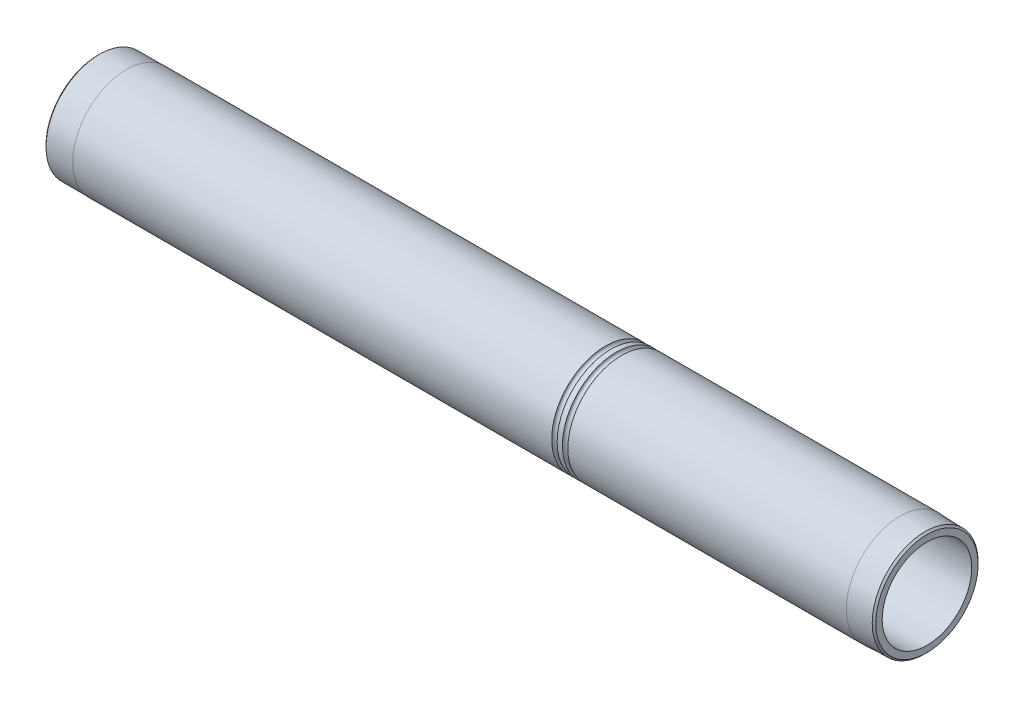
ISO-10303-21;
HEADER;
FILE_DESCRIPTION(('STEP AP214'),'2;1');
FILE_NAME('part.step','',(''),(''),'','','');
FILE_SCHEMA(('AUTOMOTIVE_DESIGN { 1 0 10303 214 1 1 1 1 }'));
ENDSEC;
DATA;
#1=APPLICATION_CONTEXT('core data for automotive mechanical design processes');
#2=APPLICATION_PROTOCOL_DEFINITION('international standard','automotive_design',2000,#1);
#3=PRODUCT_CONTEXT('',#1,'mechanical');
#4=PRODUCT('Part','Part','',(#3));
#5=PRODUCT_RELATED_PRODUCT_CATEGORY('part','',(#4));
#6=PRODUCT_DEFINITION_FORMATION('','',#4);
#7=PRODUCT_DEFINITION_CONTEXT('part definition',#1,'design');
#8=PRODUCT_DEFINITION('design','',#6,#7);
#9=PRODUCT_DEFINITION_SHAPE('','',#8);
#10=(LENGTH_UNIT() NAMED_UNIT(*) SI_UNIT(.MILLI.,.METRE.));
#11=(NAMED_UNIT(*) PLANE_ANGLE_UNIT() SI_UNIT($,.RADIAN.));
#12=(NAMED_UNIT(*) SI_UNIT($,.STERADIAN.) SOLID_ANGLE_UNIT());
#13=UNCERTAINTY_MEASURE_WITH_UNIT(LENGTH_MEASURE(1.E-05),#10,'distance_accuracy_value','');
#14=(GEOMETRIC_REPRESENTATION_CONTEXT(3) GLOBAL_UNCERTAINTY_ASSIGNED_CONTEXT((#13)) GLOBAL_UNIT_ASSIGNED_CONTEXT((#10,
#11,#12)) REPRESENTATION_CONTEXT('',''));
#15=CARTESIAN_POINT('',(0.,0.,0.));
#16=DIRECTION('',(0.,0.,1.));
#17=DIRECTION('',(1.,0.,0.));
#18=AXIS2_PLACEMENT_3D('',#15,#16,#17);
#19=CARTESIAN_POINT('',(0.,0.,0.));
#20=DIRECTION('',(-1.,0.,0.));
#21=DIRECTION('',(0.,0.,1.));
#22=AXIS2_PLACEMENT_3D('',#19,#20,#21);
#23=CYLINDRICAL_SURFACE('',#22,25.);
#24=CARTESIAN_POINT('',(165.,0.,0.));
#25=DIRECTION('',(-1.,0.,0.));
#26=DIRECTION('',(0.,0.,1.));
#27=AXIS2_PLACEMENT_3D('',#24,#25,#26);
#28=CIRCLE('',#27,25.);
#29=CARTESIAN_POINT('',(165.,0.,25.));
#30=VERTEX_POINT('',#29);
#31=EDGE_CURVE('E69',#30,#30,#28,.F.);
#32=ORIENTED_EDGE('',*,*,#31,.F.);
#33=EDGE_LOOP('',(#32));
#34=FACE_BOUND('',#33,.T.);
#35=CARTESIAN_POINT('',(211.8,0.,0.));
#36=DIRECTION('',(1.,0.,0.));
#37=DIRECTION('',(0.,0.,-1.));
#38=AXIS2_PLACEMENT_3D('',#35,#36,#37);
#39=CIRCLE('',#38,25.);
#40=CARTESIAN_POINT('',(211.8,0.,-25.));
#41=VERTEX_POINT('',#40);
#42=EDGE_CURVE('E40',#41,#41,#39,.F.);
#43=ORIENTED_EDGE('',*,*,#42,.F.);
#44=EDGE_LOOP('',(#43));
#45=FACE_BOUND('',#44,.T.);
#46=ADVANCED_FACE('F36',(#34,#45),#23,.F.);
#47=CARTESIAN_POINT('',(628.,0.,0.));
#48=DIRECTION('',(-1.,0.,0.));
#49=DIRECTION('',(0.,0.,1.));
#50=AXIS2_PLACEMENT_3D('',#47,#48,#49);
#51=CIRCLE('',#50,25.);
#52=CARTESIAN_POINT('',(628.,0.,25.));
#53=VERTEX_POINT('',#52);
#54=EDGE_CURVE('E49',#53,#53,#51,.T.);
#55=ORIENTED_EDGE('',*,*,#54,.F.);
#56=EDGE_LOOP('',(#55));
#57=FACE_BOUND('',#56,.T.);
#58=CARTESIAN_POINT('',(215.,0.,0.));
#59=DIRECTION('',(-1.,0.,0.));
#60=DIRECTION('',(0.,0.,1.));
#61=AXIS2_PLACEMENT_3D('',#58,#59,#60);
#62=CIRCLE('',#61,25.);
#63=CARTESIAN_POINT('',(215.,0.,25.));
#64=VERTEX_POINT('',#63);
#65=EDGE_CURVE('E76',#64,#64,#62,.F.);
#66=ORIENTED_EDGE('',*,*,#65,.F.);
#67=EDGE_LOOP('',(#66));
#68=FACE_BOUND('',#67,.T.);
#69=ADVANCED_FACE('F112',(#57,#68),#23,.F.);
#70=CARTESIAN_POINT('',(0.,0.,0.));
#71=DIRECTION('',(-1.,0.,0.));
#72=DIRECTION('',(0.,0.,1.));
#73=AXIS2_PLACEMENT_3D('',#70,#71,#72);
#74=CYLINDRICAL_SURFACE('',#73,30.);
#75=CARTESIAN_POINT('',(448.5,0.,0.));
#76=DIRECTION('',(1.,0.,0.));
#77=DIRECTION('',(0.,0.,-1.));
#78=AXIS2_PLACEMENT_3D('',#75,#76,#77);
#79=CIRCLE('',#78,30.);
#80=CARTESIAN_POINT('',(448.5,0.,-30.));
#81=VERTEX_POINT('',#80);
#82=EDGE_CURVE('E61',#81,#81,#79,.T.);
#83=ORIENTED_EDGE('',*,*,#82,.F.);
#84=EDGE_LOOP('',(#83));
#85=FACE_BOUND('',#84,.T.);
#86=CARTESIAN_POINT('',(181.,0.,0.));
#87=DIRECTION('',(-1.,0.,0.));
#88=DIRECTION('',(0.,0.,1.));
#89=AXIS2_PLACEMENT_3D('',#86,#87,#88);
#90=CIRCLE('',#89,30.);
#91=CARTESIAN_POINT('',(181.,0.,30.));
#92=VERTEX_POINT('',#91);
#93=EDGE_CURVE('E72',#92,#92,#90,.T.);
#94=ORIENTED_EDGE('',*,*,#93,.F.);
#95=EDGE_LOOP('',(#94));
#96=FACE_BOUND('',#95,.T.);
#97=ADVANCED_FACE('F115',(#85,#96),#74,.T.);
#98=CARTESIAN_POINT('',(454.5,0.,0.));
#99=DIRECTION('',(1.,0.,0.));
#100=DIRECTION('',(0.,0.,-1.));
#101=AXIS2_PLACEMENT_3D('',#98,#99,#100);
#102=CIRCLE('',#101,30.);
#103=CARTESIAN_POINT('',(454.5,0.,-30.));
#104=VERTEX_POINT('',#103);
#105=EDGE_CURVE('E56',#104,#104,#102,.T.);
#106=ORIENTED_EDGE('',*,*,#105,.F.);
#107=EDGE_LOOP('',(#106));
#108=FACE_BOUND('',#107,.T.);
#109=CARTESIAN_POINT('',(451.5,0.,0.));
#110=DIRECTION('',(-1.,0.,0.));
#111=DIRECTION('',(0.,0.,1.));
#112=AXIS2_PLACEMENT_3D('',#109,#110,#111);
#113=CIRCLE('',#112,30.);
#114=CARTESIAN_POINT('',(451.5,0.,30.));
#115=VERTEX_POINT('',#114);
#116=EDGE_CURVE('E64',#115,#115,#113,.T.);
#117=ORIENTED_EDGE('',*,*,#116,.F.);
#118=EDGE_LOOP('',(#117));
#119=FACE_BOUND('',#118,.T.);
#120=ADVANCED_FACE('F121',(#108,#119),#74,.T.);
#121=CARTESIAN_POINT('',(613.,0.,0.));
#122=DIRECTION('',(-1.,0.,0.));
#123=DIRECTION('',(0.,0.,1.));
#124=AXIS2_PLACEMENT_3D('',#121,#122,#123);
#125=CIRCLE('',#124,30.);
#126=CARTESIAN_POINT('',(613.,0.,30.));
#127=VERTEX_POINT('',#126);
#128=EDGE_CURVE('E60',#127,#127,#125,.T.);
#129=ORIENTED_EDGE('',*,*,#128,.T.);
#130=EDGE_LOOP('',(#129));
#131=FACE_BOUND('',#130,.T.);
#132=CARTESIAN_POINT('',(457.5,0.,0.));
#133=DIRECTION('',(-1.,0.,0.));
#134=DIRECTION('',(0.,0.,1.));
#135=AXIS2_PLACEMENT_3D('',#132,#133,#134);
#136=CIRCLE('',#135,30.);
#137=CARTESIAN_POINT('',(457.5,0.,30.));
#138=VERTEX_POINT('',#137);
#139=EDGE_CURVE('E53',#138,#138,#136,.T.);
#140=ORIENTED_EDGE('',*,*,#139,.F.);
#141=EDGE_LOOP('',(#140));
#142=FACE_BOUND('',#141,.T.);
#143=ADVANCED_FACE('F124',(#131,#142),#74,.T.);
#144=CARTESIAN_POINT('',(627.,0.,0.));
#145=DIRECTION('',(-1.,0.,0.));
#146=DIRECTION('',(0.,0.,1.));
#147=AXIS2_PLACEMENT_3D('',#144,#145,#146);
#148=CONICAL_SURFACE('',#147,29.5654131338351,0.0310319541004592);
#149=ORIENTED_EDGE('',*,*,#128,.F.);
#150=EDGE_LOOP('',(#149));
#151=FACE_BOUND('',#150,.T.);
#152=CARTESIAN_POINT('',(627.,0.,0.));
#153=DIRECTION('',(-1.,0.,0.));
#154=DIRECTION('',(0.,0.,1.));
#155=AXIS2_PLACEMENT_3D('',#152,#153,#154);
#156=CIRCLE('',#155,29.5654131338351);
#157=CARTESIAN_POINT('',(627.,0.,29.5654131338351));
#158=VERTEX_POINT('',#157);
#159=EDGE_CURVE('E10',#158,#158,#156,.T.);
#160=ORIENTED_EDGE('',*,*,#159,.T.);
#161=EDGE_LOOP('',(#160));
#162=FACE_BOUND('',#161,.T.);
#163=ADVANCED_FACE('F38',(#151,#162),#148,.T.);
#164=CARTESIAN_POINT('',(628.,0.,0.));
#165=DIRECTION('',(-1.,0.,0.));
#166=DIRECTION('',(0.,0.,1.));
#167=AXIS2_PLACEMENT_3D('',#164,#165,#166);
#168=CONICAL_SURFACE('',#167,28.5654131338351,0.785398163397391);
#169=ORIENTED_EDGE('',*,*,#159,.F.);
#170=EDGE_LOOP('',(#169));
#171=FACE_BOUND('',#170,.T.);
#172=CARTESIAN_POINT('',(628.,0.,0.));
#173=DIRECTION('',(-1.,0.,0.));
#174=DIRECTION('',(0.,0.,1.));
#175=AXIS2_PLACEMENT_3D('',#172,#173,#174);
#176=CIRCLE('',#175,28.5654131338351);
#177=CARTESIAN_POINT('',(628.,0.,28.5654131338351));
#178=VERTEX_POINT('',#177);
#179=EDGE_CURVE('E44',#178,#178,#176,.T.);
#180=ORIENTED_EDGE('',*,*,#179,.T.);
#181=EDGE_LOOP('',(#180));
#182=FACE_BOUND('',#181,.T.);
#183=ADVANCED_FACE('F130',(#171,#182),#168,.T.);
#184=CARTESIAN_POINT('',(628.,28.5654131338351,0.));
#185=DIRECTION('',(-1.,0.,0.));
#186=DIRECTION('',(0.,0.,1.));
#187=AXIS2_PLACEMENT_3D('',#184,#185,#186);
#188=PLANE('',#187);
#189=ORIENTED_EDGE('',*,*,#179,.F.);
#190=EDGE_LOOP('',(#189));
#191=FACE_BOUND('',#190,.T.);
#192=ORIENTED_EDGE('',*,*,#54,.T.);
#193=EDGE_LOOP('',(#192));
#194=FACE_BOUND('',#193,.T.);
#195=ADVANCED_FACE('F110',(#191,#194),#188,.F.);
#196=CARTESIAN_POINT('',(454.5,31.475,0.));
#197=DIRECTION('',(1.,0.,0.));
#198=DIRECTION('',(0.,0.,-1.));
#199=AXIS2_PLACEMENT_3D('',#196,#197,#198);
#200=PLANE('',#199);
#201=CARTESIAN_POINT('',(454.5,0.,0.));
#202=DIRECTION('',(-1.,0.,0.));
#203=DIRECTION('',(0.,0.,1.));
#204=AXIS2_PLACEMENT_3D('',#201,#202,#203);
#205=CIRCLE('',#204,29.975);
#206=CARTESIAN_POINT('',(454.5,0.,29.975));
#207=VERTEX_POINT('',#206);
#208=EDGE_CURVE('E57',#207,#207,#205,.T.);
#209=ORIENTED_EDGE('',*,*,#208,.T.);
#210=EDGE_LOOP('',(#209));
#211=FACE_BOUND('',#210,.T.);
#212=ORIENTED_EDGE('',*,*,#105,.T.);
#213=EDGE_LOOP('',(#212));
#214=FACE_BOUND('',#213,.T.);
#215=ADVANCED_FACE('F129',(#211,#214),#200,.T.);
#216=CARTESIAN_POINT('',(457.5,31.475,0.));
#217=DIRECTION('',(-1.,0.,0.));
#218=DIRECTION('',(0.,0.,1.));
#219=AXIS2_PLACEMENT_3D('',#216,#217,#218);
#220=PLANE('',#219);
#221=CARTESIAN_POINT('',(457.5,0.,0.));
#222=DIRECTION('',(-1.,0.,0.));
#223=DIRECTION('',(0.,0.,1.));
#224=AXIS2_PLACEMENT_3D('',#221,#222,#223);
#225=CIRCLE('',#224,29.975);
#226=CARTESIAN_POINT('',(457.5,0.,29.975));
#227=VERTEX_POINT('',#226);
#228=EDGE_CURVE('E68',#227,#227,#225,.T.);
#229=ORIENTED_EDGE('',*,*,#228,.F.);
#230=EDGE_LOOP('',(#229));
#231=FACE_BOUND('',#230,.T.);
#232=ORIENTED_EDGE('',*,*,#139,.T.);
#233=EDGE_LOOP('',(#232));
#234=FACE_BOUND('',#233,.T.);
#235=ADVANCED_FACE('F148',(#231,#234),#220,.T.);
#236=CARTESIAN_POINT('',(456.,0.,0.));
#237=DIRECTION('',(-1.,0.,0.));
#238=DIRECTION('',(0.,0.,1.));
#239=AXIS2_PLACEMENT_3D('',#236,#237,#238);
#240=TOROIDAL_SURFACE('',#239,29.975,1.5);
#241=ORIENTED_EDGE('',*,*,#228,.T.);
#242=EDGE_LOOP('',(#241));
#243=FACE_BOUND('',#242,.T.);
#244=ORIENTED_EDGE('',*,*,#208,.F.);
#245=EDGE_LOOP('',(#244));
#246=FACE_BOUND('',#245,.T.);
#247=ADVANCED_FACE('F150',(#243,#246),#240,.F.);
#248=CARTESIAN_POINT('',(451.5,31.475,0.));
#249=DIRECTION('',(-1.,0.,0.));
#250=DIRECTION('',(0.,0.,1.));
#251=AXIS2_PLACEMENT_3D('',#248,#249,#250);
#252=PLANE('',#251);
#253=CARTESIAN_POINT('',(451.5,0.,0.));
#254=DIRECTION('',(-1.,0.,0.));
#255=DIRECTION('',(0.,0.,1.));
#256=AXIS2_PLACEMENT_3D('',#253,#254,#255);
#257=CIRCLE('',#256,29.975);
#258=CARTESIAN_POINT('',(451.5,0.,29.975));
#259=VERTEX_POINT('',#258);
#260=EDGE_CURVE('E65',#259,#259,#257,.T.);
#261=ORIENTED_EDGE('',*,*,#260,.F.);
#262=EDGE_LOOP('',(#261));
#263=FACE_BOUND('',#262,.T.);
#264=ORIENTED_EDGE('',*,*,#116,.T.);
#265=EDGE_LOOP('',(#264));
#266=FACE_BOUND('',#265,.T.);
#267=ADVANCED_FACE('F157',(#263,#266),#252,.T.);
#268=CARTESIAN_POINT('',(448.5,29.975,0.));
#269=DIRECTION('',(1.,0.,0.));
#270=DIRECTION('',(0.,0.,-1.));
#271=AXIS2_PLACEMENT_3D('',#268,#269,#270);
#272=PLANE('',#271);
#273=CARTESIAN_POINT('',(448.5,0.,0.));
#274=DIRECTION('',(-1.,0.,0.));
#275=DIRECTION('',(0.,0.,1.));
#276=AXIS2_PLACEMENT_3D('',#273,#274,#275);
#277=CIRCLE('',#276,29.975);
#278=CARTESIAN_POINT('',(448.5,0.,29.975));
#279=VERTEX_POINT('',#278);
#280=EDGE_CURVE('E75',#279,#279,#277,.T.);
#281=ORIENTED_EDGE('',*,*,#280,.T.);
#282=EDGE_LOOP('',(#281));
#283=FACE_BOUND('',#282,.T.);
#284=ORIENTED_EDGE('',*,*,#82,.T.);
#285=EDGE_LOOP('',(#284));
#286=FACE_BOUND('',#285,.T.);
#287=ADVANCED_FACE('F167',(#283,#286),#272,.T.);
#288=CARTESIAN_POINT('',(450.,0.,0.));
#289=DIRECTION('',(-1.,0.,0.));
#290=DIRECTION('',(0.,0.,1.));
#291=AXIS2_PLACEMENT_3D('',#288,#289,#290);
#292=TOROIDAL_SURFACE('',#291,29.975,1.5);
#293=ORIENTED_EDGE('',*,*,#260,.T.);
#294=EDGE_LOOP('',(#293));
#295=FACE_BOUND('',#294,.T.);
#296=ORIENTED_EDGE('',*,*,#280,.F.);
#297=EDGE_LOOP('',(#296));
#298=FACE_BOUND('',#297,.T.);
#299=ADVANCED_FACE('F163',(#295,#298),#292,.F.);
#300=CARTESIAN_POINT('',(181.,29.9,0.));
#301=DIRECTION('',(-1.,0.,0.));
#302=DIRECTION('',(0.,0.,1.));
#303=AXIS2_PLACEMENT_3D('',#300,#301,#302);
#304=PLANE('',#303);
#305=CARTESIAN_POINT('',(181.,0.,0.));
#306=DIRECTION('',(-1.,0.,0.));
#307=DIRECTION('',(0.,0.,1.));
#308=AXIS2_PLACEMENT_3D('',#305,#306,#307);
#309=CIRCLE('',#308,29.9);
#310=CARTESIAN_POINT('',(181.,0.,29.9));
#311=VERTEX_POINT('',#310);
#312=EDGE_CURVE('E82',#311,#311,#309,.T.);
#313=ORIENTED_EDGE('',*,*,#312,.F.);
#314=EDGE_LOOP('',(#313));
#315=FACE_BOUND('',#314,.T.);
#316=ORIENTED_EDGE('',*,*,#93,.T.);
#317=EDGE_LOOP('',(#316));
#318=FACE_BOUND('',#317,.T.);
#319=ADVANCED_FACE('F166',(#315,#318),#304,.T.);
#320=CARTESIAN_POINT('',(165.,0.,0.));
#321=DIRECTION('',(-1.,0.,0.));
#322=DIRECTION('',(0.,0.,1.));
#323=AXIS2_PLACEMENT_3D('',#320,#321,#322);
#324=PLANE('',#323);
#325=CARTESIAN_POINT('',(165.,0.,0.));
#326=DIRECTION('',(-1.,0.,0.));
#327=DIRECTION('',(0.,0.,1.));
#328=AXIS2_PLACEMENT_3D('',#325,#326,#327);
#329=CIRCLE('',#328,28.9);
#330=CARTESIAN_POINT('',(165.,0.,28.9));
#331=VERTEX_POINT('',#330);
#332=EDGE_CURVE('E73',#331,#331,#329,.T.);
#333=ORIENTED_EDGE('',*,*,#332,.T.);
#334=EDGE_LOOP('',(#333));
#335=FACE_BOUND('',#334,.T.);
#336=ORIENTED_EDGE('',*,*,#31,.T.);
#337=EDGE_LOOP('',(#336));
#338=FACE_BOUND('',#337,.T.);
#339=ADVANCED_FACE('F175',(#335,#338),#324,.T.);
#340=CARTESIAN_POINT('',(165.,0.,0.));
#341=DIRECTION('',(1.,0.,0.));
#342=DIRECTION('',(0.,0.,-1.));
#343=AXIS2_PLACEMENT_3D('',#340,#341,#342);
#344=CONICAL_SURFACE('',#343,28.9,0.785398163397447);
#345=CARTESIAN_POINT('',(166.,0.,0.));
#346=DIRECTION('',(-1.,0.,0.));
#347=DIRECTION('',(0.,0.,1.));
#348=AXIS2_PLACEMENT_3D('',#345,#346,#347);
#349=CIRCLE('',#348,29.9);
#350=CARTESIAN_POINT('',(166.,0.,29.9));
#351=VERTEX_POINT('',#350);
#352=EDGE_CURVE('E93',#351,#351,#349,.T.);
#353=ORIENTED_EDGE('',*,*,#352,.T.);
#354=EDGE_LOOP('',(#353));
#355=FACE_BOUND('',#354,.T.);
#356=ORIENTED_EDGE('',*,*,#332,.F.);
#357=EDGE_LOOP('',(#356));
#358=FACE_BOUND('',#357,.T.);
#359=ADVANCED_FACE('F178',(#355,#358),#344,.T.);
#360=CARTESIAN_POINT('',(0.,0.,0.));
#361=DIRECTION('',(-1.,0.,0.));
#362=DIRECTION('',(0.,0.,1.));
#363=AXIS2_PLACEMENT_3D('',#360,#361,#362);
#364=CYLINDRICAL_SURFACE('',#363,29.9);
#365=ORIENTED_EDGE('',*,*,#312,.T.);
#366=EDGE_LOOP('',(#365));
#367=FACE_BOUND('',#366,.T.);
#368=ORIENTED_EDGE('',*,*,#352,.F.);
#369=EDGE_LOOP('',(#368));
#370=FACE_BOUND('',#369,.T.);
#371=ADVANCED_FACE('F182',(#367,#370),#364,.T.);
#372=CARTESIAN_POINT('',(211.8,26.75,0.));
#373=DIRECTION('',(1.,0.,0.));
#374=DIRECTION('',(0.,0.,-1.));
#375=AXIS2_PLACEMENT_3D('',#372,#373,#374);
#376=PLANE('',#375);
#377=CARTESIAN_POINT('',(211.8,0.,0.));
#378=DIRECTION('',(-1.,0.,0.));
#379=DIRECTION('',(0.,0.,1.));
#380=AXIS2_PLACEMENT_3D('',#377,#378,#379);
#381=CIRCLE('',#380,26.75);
#382=CARTESIAN_POINT('',(211.8,0.,26.75));
#383=VERTEX_POINT('',#382);
#384=EDGE_CURVE('E84',#383,#383,#381,.T.);
#385=ORIENTED_EDGE('',*,*,#384,.F.);
#386=EDGE_LOOP('',(#385));
#387=FACE_BOUND('',#386,.T.);
#388=ORIENTED_EDGE('',*,*,#42,.T.);
#389=EDGE_LOOP('',(#388));
#390=FACE_BOUND('',#389,.T.);
#391=ADVANCED_FACE('F186',(#387,#390),#376,.T.);
#392=CARTESIAN_POINT('',(215.,26.75,0.));
#393=DIRECTION('',(-1.,0.,0.));
#394=DIRECTION('',(0.,0.,1.));
#395=AXIS2_PLACEMENT_3D('',#392,#393,#394);
#396=PLANE('',#395);
#397=CARTESIAN_POINT('',(215.,0.,0.));
#398=DIRECTION('',(-1.,0.,0.));
#399=DIRECTION('',(0.,0.,1.));
#400=AXIS2_PLACEMENT_3D('',#397,#398,#399);
#401=CIRCLE('',#400,26.75);
#402=CARTESIAN_POINT('',(215.,0.,26.75));
#403=VERTEX_POINT('',#402);
#404=EDGE_CURVE('E78',#403,#403,#401,.T.);
#405=ORIENTED_EDGE('',*,*,#404,.T.);
#406=EDGE_LOOP('',(#405));
#407=FACE_BOUND('',#406,.T.);
#408=ORIENTED_EDGE('',*,*,#65,.T.);
#409=EDGE_LOOP('',(#408));
#410=FACE_BOUND('',#409,.T.);
#411=ADVANCED_FACE('F193',(#407,#410),#396,.T.);
#412=CARTESIAN_POINT('',(211.8,0.,0.));
#413=DIRECTION('',(-1.,0.,0.));
#414=DIRECTION('',(0.,0.,1.));
#415=AXIS2_PLACEMENT_3D('',#412,#413,#414);
#416=CYLINDRICAL_SURFACE('',#415,26.75);
#417=ORIENTED_EDGE('',*,*,#384,.T.);
#418=EDGE_LOOP('',(#417));
#419=FACE_BOUND('',#418,.T.);
#420=ORIENTED_EDGE('',*,*,#404,.F.);
#421=EDGE_LOOP('',(#420));
#422=FACE_BOUND('',#421,.T.);
#423=ADVANCED_FACE('F197',(#419,#422),#416,.F.);
#424=CLOSED_SHELL('',(#46,#69,#97,#120,#143,#163,#183,#195,#215,#235,#247,#267,#287,#299,#319,
#339,#359,#371,#391,#411,#423));
#425=MANIFOLD_SOLID_BREP('B2',#424);
#426=ADVANCED_BREP_SHAPE_REPRESENTATION('',(#18,#425),#14);
#427=SHAPE_DEFINITION_REPRESENTATION(#9,#426);
ENDSEC;
END-ISO-10303-21;
